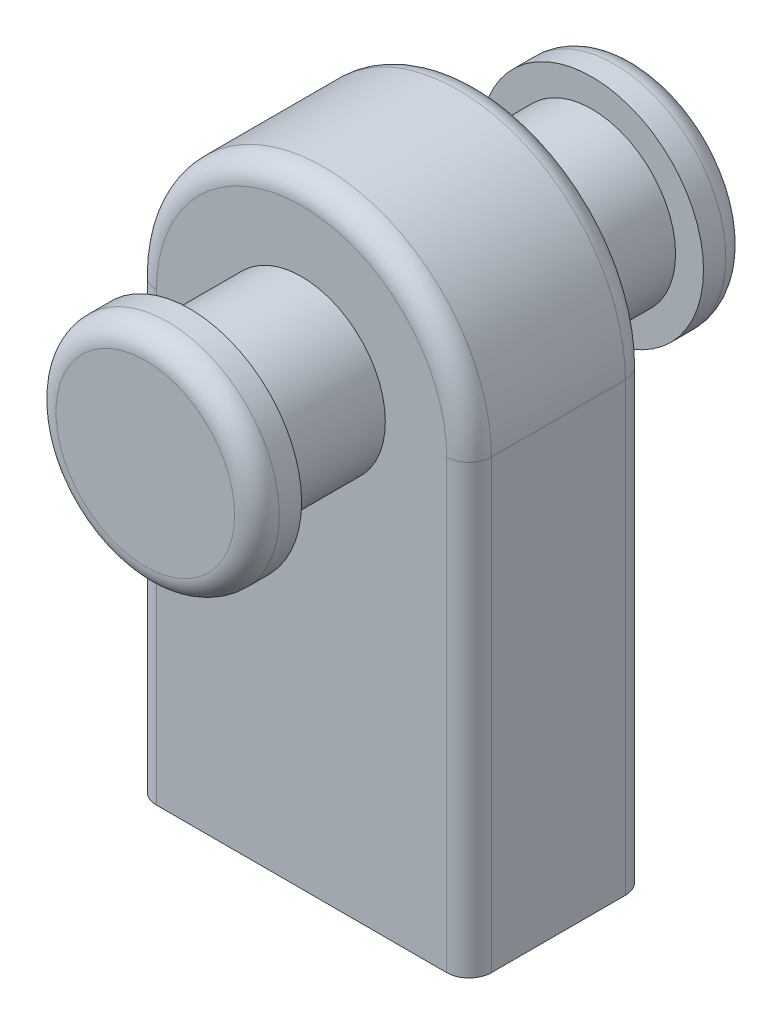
ISO-10303-21;
HEADER;
FILE_DESCRIPTION(('STEP AP214'),'2;1');
FILE_NAME('part.step','',(''),(''),'','','');
FILE_SCHEMA(('AUTOMOTIVE_DESIGN { 1 0 10303 214 1 1 1 1 }'));
ENDSEC;
DATA;
#1=APPLICATION_CONTEXT('core data for automotive mechanical design processes');
#2=APPLICATION_PROTOCOL_DEFINITION('international standard','automotive_design',2000,#1);
#3=PRODUCT_CONTEXT('',#1,'mechanical');
#4=PRODUCT('Part','Part','',(#3));
#5=PRODUCT_RELATED_PRODUCT_CATEGORY('part','',(#4));
#6=PRODUCT_DEFINITION_FORMATION('','',#4);
#7=PRODUCT_DEFINITION_CONTEXT('part definition',#1,'design');
#8=PRODUCT_DEFINITION('design','',#6,#7);
#9=PRODUCT_DEFINITION_SHAPE('','',#8);
#10=(LENGTH_UNIT() NAMED_UNIT(*) SI_UNIT(.MILLI.,.METRE.));
#11=(NAMED_UNIT(*) PLANE_ANGLE_UNIT() SI_UNIT($,.RADIAN.));
#12=(NAMED_UNIT(*) SI_UNIT($,.STERADIAN.) SOLID_ANGLE_UNIT());
#13=UNCERTAINTY_MEASURE_WITH_UNIT(LENGTH_MEASURE(1.E-05),#10,'distance_accuracy_value','');
#14=(GEOMETRIC_REPRESENTATION_CONTEXT(3) GLOBAL_UNCERTAINTY_ASSIGNED_CONTEXT((#13)) GLOBAL_UNIT_ASSIGNED_CONTEXT((#10,
#11,#12)) REPRESENTATION_CONTEXT('',''));
#15=CARTESIAN_POINT('',(0.,0.,0.));
#16=DIRECTION('',(0.,0.,1.));
#17=DIRECTION('',(1.,0.,0.));
#18=AXIS2_PLACEMENT_3D('',#15,#16,#17);
#19=CARTESIAN_POINT('',(0.,0.,10.16));
#20=DIRECTION('',(0.,0.,-1.));
#21=DIRECTION('',(-1.,0.,0.));
#22=AXIS2_PLACEMENT_3D('',#19,#20,#21);
#23=CYLINDRICAL_SURFACE('',#22,19.05);
#24=DIRECTION('',(0.,0.,-1.));
#25=VECTOR('',#24,1.);
#26=CARTESIAN_POINT('',(19.05,0.,10.16));
#27=LINE('',#26,#25);
#28=CARTESIAN_POINT('',(19.05,0.,7.62));
#29=VERTEX_POINT('',#28);
#30=CARTESIAN_POINT('',(19.05,0.,-7.62));
#31=VERTEX_POINT('',#30);
#32=EDGE_CURVE('E112',#29,#31,#27,.T.);
#33=ORIENTED_EDGE('',*,*,#32,.T.);
#34=CARTESIAN_POINT('',(0.,0.,-7.62));
#35=DIRECTION('',(0.,0.,1.));
#36=DIRECTION('',(1.,0.,0.));
#37=AXIS2_PLACEMENT_3D('',#34,#35,#36);
#38=CIRCLE('',#37,19.05);
#39=CARTESIAN_POINT('',(-19.05,0.,-7.62));
#40=VERTEX_POINT('',#39);
#41=EDGE_CURVE('E137',#31,#40,#38,.T.);
#42=ORIENTED_EDGE('',*,*,#41,.T.);
#43=DIRECTION('',(0.,0.,-1.));
#44=VECTOR('',#43,1.);
#45=CARTESIAN_POINT('',(-19.05,0.,10.16));
#46=LINE('',#45,#44);
#47=CARTESIAN_POINT('',(-19.05,0.,7.62));
#48=VERTEX_POINT('',#47);
#49=EDGE_CURVE('E167',#48,#40,#46,.T.);
#50=ORIENTED_EDGE('',*,*,#49,.F.);
#51=CARTESIAN_POINT('',(0.,0.,7.62));
#52=DIRECTION('',(0.,0.,1.));
#53=DIRECTION('',(1.,0.,0.));
#54=AXIS2_PLACEMENT_3D('',#51,#52,#53);
#55=CIRCLE('',#54,19.05);
#56=EDGE_CURVE('E135',#48,#29,#55,.F.);
#57=ORIENTED_EDGE('',*,*,#56,.T.);
#58=EDGE_LOOP('',(#33,#42,#50,#57));
#59=FACE_BOUND('',#58,.T.);
#60=ADVANCED_FACE('F34',(#59),#23,.T.);
#61=CARTESIAN_POINT('',(-19.05,0.,10.16));
#62=DIRECTION('',(1.,0.,0.));
#63=DIRECTION('',(0.,1.,0.));
#64=AXIS2_PLACEMENT_3D('',#61,#62,#63);
#65=PLANE('',#64);
#66=ORIENTED_EDGE('',*,*,#49,.T.);
#67=DIRECTION('',(0.,-1.,0.));
#68=VECTOR('',#67,1.);
#69=CARTESIAN_POINT('',(-19.05,0.,-7.62));
#70=LINE('',#69,#68);
#71=CARTESIAN_POINT('',(-19.05,-50.8,-7.62));
#72=VERTEX_POINT('',#71);
#73=EDGE_CURVE('E165',#40,#72,#70,.T.);
#74=ORIENTED_EDGE('',*,*,#73,.T.);
#75=DIRECTION('',(0.,0.,-1.));
#76=VECTOR('',#75,1.);
#77=CARTESIAN_POINT('',(-19.05,-50.8,10.16));
#78=LINE('',#77,#76);
#79=CARTESIAN_POINT('',(-19.05,-50.8,7.62));
#80=VERTEX_POINT('',#79);
#81=EDGE_CURVE('E158',#80,#72,#78,.T.);
#82=ORIENTED_EDGE('',*,*,#81,.F.);
#83=DIRECTION('',(0.,-1.,0.));
#84=VECTOR('',#83,1.);
#85=CARTESIAN_POINT('',(-19.05,0.,7.62));
#86=LINE('',#85,#84);
#87=EDGE_CURVE('E156',#80,#48,#86,.F.);
#88=ORIENTED_EDGE('',*,*,#87,.T.);
#89=EDGE_LOOP('',(#66,#74,#82,#88));
#90=FACE_BOUND('',#89,.T.);
#91=ADVANCED_FACE('F162',(#90),#65,.F.);
#92=CARTESIAN_POINT('',(19.05,0.,10.16));
#93=DIRECTION('',(1.,0.,0.));
#94=DIRECTION('',(0.,1.,0.));
#95=AXIS2_PLACEMENT_3D('',#92,#93,#94);
#96=PLANE('',#95);
#97=DIRECTION('',(0.,0.,-1.));
#98=VECTOR('',#97,1.);
#99=CARTESIAN_POINT('',(19.05,-50.8,10.16));
#100=LINE('',#99,#98);
#101=CARTESIAN_POINT('',(19.05,-50.8,7.62));
#102=VERTEX_POINT('',#101);
#103=CARTESIAN_POINT('',(19.05,-50.8,-7.62));
#104=VERTEX_POINT('',#103);
#105=EDGE_CURVE('E102',#102,#104,#100,.T.);
#106=ORIENTED_EDGE('',*,*,#105,.T.);
#107=DIRECTION('',(0.,-1.,0.));
#108=VECTOR('',#107,1.);
#109=CARTESIAN_POINT('',(19.05,0.,-7.62));
#110=LINE('',#109,#108);
#111=EDGE_CURVE('E185',#104,#31,#110,.F.);
#112=ORIENTED_EDGE('',*,*,#111,.T.);
#113=ORIENTED_EDGE('',*,*,#32,.F.);
#114=DIRECTION('',(0.,-1.,0.));
#115=VECTOR('',#114,1.);
#116=CARTESIAN_POINT('',(19.05,0.,7.62));
#117=LINE('',#116,#115);
#118=EDGE_CURVE('E183',#29,#102,#117,.T.);
#119=ORIENTED_EDGE('',*,*,#118,.T.);
#120=EDGE_LOOP('',(#106,#112,#113,#119));
#121=FACE_BOUND('',#120,.T.);
#122=ADVANCED_FACE('F192',(#121),#96,.T.);
#123=CARTESIAN_POINT('',(0.,0.,10.16));
#124=DIRECTION('',(0.,0.,1.));
#125=DIRECTION('',(1.,0.,0.));
#126=AXIS2_PLACEMENT_3D('',#123,#124,#125);
#127=PLANE('',#126);
#128=DIRECTION('',(-1.,0.,0.));
#129=VECTOR('',#128,1.);
#130=CARTESIAN_POINT('',(0.,-50.8,10.16));
#131=LINE('',#130,#129);
#132=CARTESIAN_POINT('',(16.51,-50.8,10.16));
#133=VERTEX_POINT('',#132);
#134=CARTESIAN_POINT('',(-16.51,-50.8,10.16));
#135=VERTEX_POINT('',#134);
#136=EDGE_CURVE('E100',#133,#135,#131,.T.);
#137=ORIENTED_EDGE('',*,*,#136,.F.);
#138=DIRECTION('',(0.,-1.,0.));
#139=VECTOR('',#138,1.);
#140=CARTESIAN_POINT('',(16.51,0.,10.16));
#141=LINE('',#140,#139);
#142=CARTESIAN_POINT('',(16.51,0.,10.16));
#143=VERTEX_POINT('',#142);
#144=EDGE_CURVE('E56',#133,#143,#141,.F.);
#145=ORIENTED_EDGE('',*,*,#144,.T.);
#146=CARTESIAN_POINT('',(0.,0.,10.16));
#147=DIRECTION('',(0.,0.,1.));
#148=DIRECTION('',(1.,0.,0.));
#149=AXIS2_PLACEMENT_3D('',#146,#147,#148);
#150=CIRCLE('',#149,16.51);
#151=CARTESIAN_POINT('',(-16.51,0.,10.16));
#152=VERTEX_POINT('',#151);
#153=EDGE_CURVE('E51',#143,#152,#150,.T.);
#154=ORIENTED_EDGE('',*,*,#153,.T.);
#155=DIRECTION('',(0.,-1.,0.));
#156=VECTOR('',#155,1.);
#157=CARTESIAN_POINT('',(-16.51,-50.8,10.16));
#158=LINE('',#157,#156);
#159=EDGE_CURVE('E110',#152,#135,#158,.T.);
#160=ORIENTED_EDGE('',*,*,#159,.T.);
#161=EDGE_LOOP('',(#137,#145,#154,#160));
#162=FACE_BOUND('',#161,.T.);
#163=CARTESIAN_POINT('',(0.,0.,10.16));
#164=DIRECTION('',(0.,0.,1.));
#165=DIRECTION('',(1.,0.,0.));
#166=AXIS2_PLACEMENT_3D('',#163,#164,#165);
#167=CIRCLE('',#166,9.525);
#168=CARTESIAN_POINT('',(9.525,0.,10.16));
#169=VERTEX_POINT('',#168);
#170=EDGE_CURVE('E210',#169,#169,#167,.F.);
#171=ORIENTED_EDGE('',*,*,#170,.T.);
#172=EDGE_LOOP('',(#171));
#173=FACE_BOUND('',#172,.T.);
#174=ADVANCED_FACE('F108',(#162,#173),#127,.T.);
#175=CARTESIAN_POINT('',(0.,0.,-10.16));
#176=DIRECTION('',(0.,0.,1.));
#177=DIRECTION('',(1.,0.,0.));
#178=AXIS2_PLACEMENT_3D('',#175,#176,#177);
#179=PLANE('',#178);
#180=CARTESIAN_POINT('',(0.,0.,-10.16));
#181=DIRECTION('',(0.,0.,1.));
#182=DIRECTION('',(1.,0.,0.));
#183=AXIS2_PLACEMENT_3D('',#180,#181,#182);
#184=CIRCLE('',#183,9.525);
#185=CARTESIAN_POINT('',(9.525,0.,-10.16));
#186=VERTEX_POINT('',#185);
#187=EDGE_CURVE('E169',#186,#186,#184,.F.);
#188=ORIENTED_EDGE('',*,*,#187,.F.);
#189=EDGE_LOOP('',(#188));
#190=FACE_BOUND('',#189,.T.);
#191=CARTESIAN_POINT('',(0.,0.,-10.16));
#192=DIRECTION('',(0.,0.,1.));
#193=DIRECTION('',(1.,0.,0.));
#194=AXIS2_PLACEMENT_3D('',#191,#192,#193);
#195=CIRCLE('',#194,16.51);
#196=CARTESIAN_POINT('',(-16.51,0.,-10.16));
#197=VERTEX_POINT('',#196);
#198=CARTESIAN_POINT('',(16.51,0.,-10.16));
#199=VERTEX_POINT('',#198);
#200=EDGE_CURVE('E176',#197,#199,#195,.F.);
#201=ORIENTED_EDGE('',*,*,#200,.T.);
#202=DIRECTION('',(0.,-1.,0.));
#203=VECTOR('',#202,1.);
#204=CARTESIAN_POINT('',(16.51,-50.8,-10.16));
#205=LINE('',#204,#203);
#206=CARTESIAN_POINT('',(16.51,-50.8,-10.16));
#207=VERTEX_POINT('',#206);
#208=EDGE_CURVE('E180',#199,#207,#205,.T.);
#209=ORIENTED_EDGE('',*,*,#208,.T.);
#210=DIRECTION('',(-1.,0.,0.));
#211=VECTOR('',#210,1.);
#212=CARTESIAN_POINT('',(0.,-50.8,-10.16));
#213=LINE('',#212,#211);
#214=CARTESIAN_POINT('',(-16.51,-50.8,-10.16));
#215=VERTEX_POINT('',#214);
#216=EDGE_CURVE('E113',#207,#215,#213,.T.);
#217=ORIENTED_EDGE('',*,*,#216,.T.);
#218=DIRECTION('',(0.,-1.,0.));
#219=VECTOR('',#218,1.);
#220=CARTESIAN_POINT('',(-16.51,0.,-10.16));
#221=LINE('',#220,#219);
#222=EDGE_CURVE('E178',#215,#197,#221,.F.);
#223=ORIENTED_EDGE('',*,*,#222,.T.);
#224=EDGE_LOOP('',(#201,#209,#217,#223));
#225=FACE_BOUND('',#224,.T.);
#226=ADVANCED_FACE('F206',(#190,#225),#179,.F.);
#227=CARTESIAN_POINT('',(0.,0.,22.86));
#228=DIRECTION('',(0.,0.,-1.));
#229=DIRECTION('',(-1.,0.,0.));
#230=AXIS2_PLACEMENT_3D('',#227,#228,#229);
#231=CYLINDRICAL_SURFACE('',#230,9.525);
#232=CARTESIAN_POINT('',(0.,0.,-22.86));
#233=DIRECTION('',(0.,0.,1.));
#234=DIRECTION('',(1.,0.,0.));
#235=AXIS2_PLACEMENT_3D('',#232,#233,#234);
#236=CIRCLE('',#235,9.525);
#237=CARTESIAN_POINT('',(9.525,0.,-22.86));
#238=VERTEX_POINT('',#237);
#239=EDGE_CURVE('E216',#238,#238,#236,.T.);
#240=ORIENTED_EDGE('',*,*,#239,.T.);
#241=EDGE_LOOP('',(#240));
#242=FACE_BOUND('',#241,.T.);
#243=ORIENTED_EDGE('',*,*,#187,.T.);
#244=EDGE_LOOP('',(#243));
#245=FACE_BOUND('',#244,.T.);
#246=ADVANCED_FACE('F287',(#242,#245),#231,.T.);
#247=ORIENTED_EDGE('',*,*,#170,.F.);
#248=EDGE_LOOP('',(#247));
#249=FACE_BOUND('',#248,.T.);
#250=CARTESIAN_POINT('',(0.,0.,22.86));
#251=DIRECTION('',(0.,0.,1.));
#252=DIRECTION('',(1.,0.,0.));
#253=AXIS2_PLACEMENT_3D('',#250,#251,#252);
#254=CIRCLE('',#253,9.525);
#255=CARTESIAN_POINT('',(9.525,0.,22.86));
#256=VERTEX_POINT('',#255);
#257=EDGE_CURVE('E213',#256,#256,#254,.T.);
#258=ORIENTED_EDGE('',*,*,#257,.F.);
#259=EDGE_LOOP('',(#258));
#260=FACE_BOUND('',#259,.T.);
#261=ADVANCED_FACE('F281',(#249,#260),#231,.T.);
#262=CARTESIAN_POINT('',(0.,0.,27.94));
#263=DIRECTION('',(0.,0.,-1.));
#264=DIRECTION('',(-1.,0.,0.));
#265=AXIS2_PLACEMENT_3D('',#262,#263,#264);
#266=CYLINDRICAL_SURFACE('',#265,12.7);
#267=CARTESIAN_POINT('',(0.,0.,25.4));
#268=DIRECTION('',(0.,0.,1.));
#269=DIRECTION('',(1.,0.,0.));
#270=AXIS2_PLACEMENT_3D('',#267,#268,#269);
#271=CIRCLE('',#270,12.7);
#272=CARTESIAN_POINT('',(12.7,0.,25.4));
#273=VERTEX_POINT('',#272);
#274=EDGE_CURVE('E122',#273,#273,#271,.F.);
#275=ORIENTED_EDGE('',*,*,#274,.T.);
#276=EDGE_LOOP('',(#275));
#277=FACE_BOUND('',#276,.T.);
#278=CARTESIAN_POINT('',(0.,0.,22.86));
#279=DIRECTION('',(0.,0.,1.));
#280=DIRECTION('',(1.,0.,0.));
#281=AXIS2_PLACEMENT_3D('',#278,#279,#280);
#282=CIRCLE('',#281,12.7);
#283=CARTESIAN_POINT('',(12.7,0.,22.86));
#284=VERTEX_POINT('',#283);
#285=EDGE_CURVE('E219',#284,#284,#282,.T.);
#286=ORIENTED_EDGE('',*,*,#285,.T.);
#287=EDGE_LOOP('',(#286));
#288=FACE_BOUND('',#287,.T.);
#289=ADVANCED_FACE('F277',(#277,#288),#266,.T.);
#290=CARTESIAN_POINT('',(0.,0.,27.94));
#291=DIRECTION('',(0.,0.,1.));
#292=DIRECTION('',(1.,0.,0.));
#293=AXIS2_PLACEMENT_3D('',#290,#291,#292);
#294=PLANE('',#293);
#295=CARTESIAN_POINT('',(0.,0.,27.94));
#296=DIRECTION('',(0.,0.,1.));
#297=DIRECTION('',(1.,0.,0.));
#298=AXIS2_PLACEMENT_3D('',#295,#296,#297);
#299=CIRCLE('',#298,10.16);
#300=CARTESIAN_POINT('',(10.16,0.,27.94));
#301=VERTEX_POINT('',#300);
#302=EDGE_CURVE('E119',#301,#301,#299,.T.);
#303=ORIENTED_EDGE('',*,*,#302,.T.);
#304=EDGE_LOOP('',(#303));
#305=FACE_BOUND('',#304,.T.);
#306=ADVANCED_FACE('F241',(#305),#294,.T.);
#307=CARTESIAN_POINT('',(0.,0.,22.86));
#308=DIRECTION('',(0.,0.,1.));
#309=DIRECTION('',(1.,0.,0.));
#310=AXIS2_PLACEMENT_3D('',#307,#308,#309);
#311=PLANE('',#310);
#312=ORIENTED_EDGE('',*,*,#257,.T.);
#313=EDGE_LOOP('',(#312));
#314=FACE_BOUND('',#313,.T.);
#315=ORIENTED_EDGE('',*,*,#285,.F.);
#316=EDGE_LOOP('',(#315));
#317=FACE_BOUND('',#316,.T.);
#318=ADVANCED_FACE('F232',(#314,#317),#311,.F.);
#319=CARTESIAN_POINT('',(0.,0.,-27.94));
#320=DIRECTION('',(0.,0.,1.));
#321=DIRECTION('',(1.,0.,0.));
#322=AXIS2_PLACEMENT_3D('',#319,#320,#321);
#323=CYLINDRICAL_SURFACE('',#322,12.7);
#324=CARTESIAN_POINT('',(0.,0.,-25.4));
#325=DIRECTION('',(0.,0.,-1.));
#326=DIRECTION('',(-1.,0.,0.));
#327=AXIS2_PLACEMENT_3D('',#324,#325,#326);
#328=CIRCLE('',#327,12.7);
#329=CARTESIAN_POINT('',(-12.7,0.,-25.4));
#330=VERTEX_POINT('',#329);
#331=EDGE_CURVE('E129',#330,#330,#328,.F.);
#332=ORIENTED_EDGE('',*,*,#331,.T.);
#333=EDGE_LOOP('',(#332));
#334=FACE_BOUND('',#333,.T.);
#335=CARTESIAN_POINT('',(0.,0.,-22.86));
#336=DIRECTION('',(0.,0.,1.));
#337=DIRECTION('',(1.,0.,0.));
#338=AXIS2_PLACEMENT_3D('',#335,#336,#337);
#339=CIRCLE('',#338,12.7);
#340=CARTESIAN_POINT('',(12.7,0.,-22.86));
#341=VERTEX_POINT('',#340);
#342=EDGE_CURVE('E147',#341,#341,#339,.T.);
#343=ORIENTED_EDGE('',*,*,#342,.F.);
#344=EDGE_LOOP('',(#343));
#345=FACE_BOUND('',#344,.T.);
#346=ADVANCED_FACE('F229',(#334,#345),#323,.T.);
#347=CARTESIAN_POINT('',(0.,0.,-27.94));
#348=DIRECTION('',(0.,0.,-1.));
#349=DIRECTION('',(1.,0.,0.));
#350=AXIS2_PLACEMENT_3D('',#347,#348,#349);
#351=PLANE('',#350);
#352=CARTESIAN_POINT('',(0.,0.,-27.94));
#353=DIRECTION('',(0.,0.,-1.));
#354=DIRECTION('',(-1.,0.,0.));
#355=AXIS2_PLACEMENT_3D('',#352,#353,#354);
#356=CIRCLE('',#355,10.16);
#357=CARTESIAN_POINT('',(-10.16,0.,-27.94));
#358=VERTEX_POINT('',#357);
#359=EDGE_CURVE('E132',#358,#358,#356,.T.);
#360=ORIENTED_EDGE('',*,*,#359,.T.);
#361=EDGE_LOOP('',(#360));
#362=FACE_BOUND('',#361,.T.);
#363=ADVANCED_FACE('F231',(#362),#351,.T.);
#364=CARTESIAN_POINT('',(0.,0.,-22.86));
#365=DIRECTION('',(0.,0.,-1.));
#366=DIRECTION('',(1.,0.,0.));
#367=AXIS2_PLACEMENT_3D('',#364,#365,#366);
#368=PLANE('',#367);
#369=ORIENTED_EDGE('',*,*,#239,.F.);
#370=EDGE_LOOP('',(#369));
#371=FACE_BOUND('',#370,.T.);
#372=ORIENTED_EDGE('',*,*,#342,.T.);
#373=EDGE_LOOP('',(#372));
#374=FACE_BOUND('',#373,.T.);
#375=ADVANCED_FACE('F227',(#371,#374),#368,.F.);
#376=CARTESIAN_POINT('',(-16.51,0.,-7.62));
#377=DIRECTION('',(0.,-1.,0.));
#378=DIRECTION('',(1.,0.,0.));
#379=AXIS2_PLACEMENT_3D('',#376,#377,#378);
#380=CYLINDRICAL_SURFACE('',#379,2.54);
#381=CARTESIAN_POINT('',(-16.51,-50.8,-7.62));
#382=DIRECTION('',(0.,-1.,0.));
#383=DIRECTION('',(0.,0.,-1.));
#384=AXIS2_PLACEMENT_3D('',#381,#382,#383);
#385=CIRCLE('',#384,2.54);
#386=EDGE_CURVE('E106',#72,#215,#385,.T.);
#387=ORIENTED_EDGE('',*,*,#386,.F.);
#388=ORIENTED_EDGE('',*,*,#73,.F.);
#389=CARTESIAN_POINT('',(-16.51,0.,-7.62));
#390=DIRECTION('',(0.,1.,0.));
#391=DIRECTION('',(-1.,0.,0.));
#392=AXIS2_PLACEMENT_3D('',#389,#390,#391);
#393=CIRCLE('',#392,2.54);
#394=EDGE_CURVE('E145',#197,#40,#393,.T.);
#395=ORIENTED_EDGE('',*,*,#394,.F.);
#396=ORIENTED_EDGE('',*,*,#222,.F.);
#397=EDGE_LOOP('',(#387,#388,#395,#396));
#398=FACE_BOUND('',#397,.T.);
#399=ADVANCED_FACE('F209',(#398),#380,.T.);
#400=CARTESIAN_POINT('',(0.,0.,-7.62));
#401=DIRECTION('',(0.,0.,1.));
#402=DIRECTION('',(1.,0.,0.));
#403=AXIS2_PLACEMENT_3D('',#400,#401,#402);
#404=TOROIDAL_SURFACE('',#403,16.51,2.54);
#405=ORIENTED_EDGE('',*,*,#394,.T.);
#406=ORIENTED_EDGE('',*,*,#41,.F.);
#407=CARTESIAN_POINT('',(16.51,0.,-7.62));
#408=DIRECTION('',(0.,-1.,0.));
#409=DIRECTION('',(1.,0.,0.));
#410=AXIS2_PLACEMENT_3D('',#407,#408,#409);
#411=CIRCLE('',#410,2.54);
#412=EDGE_CURVE('E142',#199,#31,#411,.T.);
#413=ORIENTED_EDGE('',*,*,#412,.F.);
#414=ORIENTED_EDGE('',*,*,#200,.F.);
#415=EDGE_LOOP('',(#405,#406,#413,#414));
#416=FACE_BOUND('',#415,.T.);
#417=ADVANCED_FACE('F199',(#416),#404,.T.);
#418=CARTESIAN_POINT('',(16.51,0.,-7.62));
#419=DIRECTION('',(0.,1.,0.));
#420=DIRECTION('',(-1.,0.,0.));
#421=AXIS2_PLACEMENT_3D('',#418,#419,#420);
#422=CYLINDRICAL_SURFACE('',#421,2.54);
#423=ORIENTED_EDGE('',*,*,#412,.T.);
#424=ORIENTED_EDGE('',*,*,#111,.F.);
#425=CARTESIAN_POINT('',(16.51,-50.8,-7.62));
#426=DIRECTION('',(0.,-1.,0.));
#427=DIRECTION('',(0.,0.,-1.));
#428=AXIS2_PLACEMENT_3D('',#425,#426,#427);
#429=CIRCLE('',#428,2.54);
#430=EDGE_CURVE('E139',#207,#104,#429,.T.);
#431=ORIENTED_EDGE('',*,*,#430,.F.);
#432=ORIENTED_EDGE('',*,*,#208,.F.);
#433=EDGE_LOOP('',(#423,#424,#431,#432));
#434=FACE_BOUND('',#433,.T.);
#435=ADVANCED_FACE('F203',(#434),#422,.T.);
#436=CARTESIAN_POINT('',(-16.51,0.,7.62));
#437=DIRECTION('',(0.,1.,0.));
#438=DIRECTION('',(-1.,0.,0.));
#439=AXIS2_PLACEMENT_3D('',#436,#437,#438);
#440=CYLINDRICAL_SURFACE('',#439,2.54);
#441=CARTESIAN_POINT('',(-16.51,-50.8,7.62));
#442=DIRECTION('',(0.,-1.,0.));
#443=DIRECTION('',(0.,0.,-1.));
#444=AXIS2_PLACEMENT_3D('',#441,#442,#443);
#445=CIRCLE('',#444,2.54);
#446=EDGE_CURVE('E11',#135,#80,#445,.T.);
#447=ORIENTED_EDGE('',*,*,#446,.F.);
#448=ORIENTED_EDGE('',*,*,#159,.F.);
#449=CARTESIAN_POINT('',(-16.51,0.,7.62));
#450=DIRECTION('',(0.,1.,0.));
#451=DIRECTION('',(-1.,0.,0.));
#452=AXIS2_PLACEMENT_3D('',#449,#450,#451);
#453=CIRCLE('',#452,2.54);
#454=EDGE_CURVE('E38',#48,#152,#453,.T.);
#455=ORIENTED_EDGE('',*,*,#454,.F.);
#456=ORIENTED_EDGE('',*,*,#87,.F.);
#457=EDGE_LOOP('',(#447,#448,#455,#456));
#458=FACE_BOUND('',#457,.T.);
#459=ADVANCED_FACE('F155',(#458),#440,.T.);
#460=CARTESIAN_POINT('',(0.,0.,7.62));
#461=DIRECTION('',(0.,0.,1.));
#462=DIRECTION('',(1.,0.,0.));
#463=AXIS2_PLACEMENT_3D('',#460,#461,#462);
#464=TOROIDAL_SURFACE('',#463,16.51,2.54);
#465=ORIENTED_EDGE('',*,*,#454,.T.);
#466=ORIENTED_EDGE('',*,*,#153,.F.);
#467=CARTESIAN_POINT('',(16.51,0.,7.62));
#468=DIRECTION('',(0.,-1.,0.));
#469=DIRECTION('',(0.,0.,-1.));
#470=AXIS2_PLACEMENT_3D('',#467,#468,#469);
#471=CIRCLE('',#470,2.54);
#472=EDGE_CURVE('E118',#29,#143,#471,.T.);
#473=ORIENTED_EDGE('',*,*,#472,.F.);
#474=ORIENTED_EDGE('',*,*,#56,.F.);
#475=EDGE_LOOP('',(#465,#466,#473,#474));
#476=FACE_BOUND('',#475,.T.);
#477=ADVANCED_FACE('F152',(#476),#464,.T.);
#478=CARTESIAN_POINT('',(16.51,0.,7.62));
#479=DIRECTION('',(0.,-1.,0.));
#480=DIRECTION('',(1.,0.,0.));
#481=AXIS2_PLACEMENT_3D('',#478,#479,#480);
#482=CYLINDRICAL_SURFACE('',#481,2.54);
#483=ORIENTED_EDGE('',*,*,#472,.T.);
#484=ORIENTED_EDGE('',*,*,#144,.F.);
#485=CARTESIAN_POINT('',(16.51,-50.8,7.62));
#486=DIRECTION('',(0.,-1.,0.));
#487=DIRECTION('',(0.,0.,-1.));
#488=AXIS2_PLACEMENT_3D('',#485,#486,#487);
#489=CIRCLE('',#488,2.54);
#490=EDGE_CURVE('E43',#102,#133,#489,.T.);
#491=ORIENTED_EDGE('',*,*,#490,.F.);
#492=ORIENTED_EDGE('',*,*,#118,.F.);
#493=EDGE_LOOP('',(#483,#484,#491,#492));
#494=FACE_BOUND('',#493,.T.);
#495=ADVANCED_FACE('F116',(#494),#482,.T.);
#496=CARTESIAN_POINT('',(0.,0.,25.4));
#497=DIRECTION('',(0.,0.,1.));
#498=DIRECTION('',(1.,0.,0.));
#499=AXIS2_PLACEMENT_3D('',#496,#497,#498);
#500=TOROIDAL_SURFACE('',#499,10.16,2.54);
#501=ORIENTED_EDGE('',*,*,#274,.F.);
#502=EDGE_LOOP('',(#501));
#503=FACE_BOUND('',#502,.T.);
#504=ORIENTED_EDGE('',*,*,#302,.F.);
#505=EDGE_LOOP('',(#504));
#506=FACE_BOUND('',#505,.T.);
#507=ADVANCED_FACE('F262',(#503,#506),#500,.T.);
#508=CARTESIAN_POINT('',(0.,0.,-25.4));
#509=DIRECTION('',(0.,0.,-1.));
#510=DIRECTION('',(-1.,0.,0.));
#511=AXIS2_PLACEMENT_3D('',#508,#509,#510);
#512=TOROIDAL_SURFACE('',#511,10.16,2.54);
#513=ORIENTED_EDGE('',*,*,#359,.F.);
#514=EDGE_LOOP('',(#513));
#515=FACE_BOUND('',#514,.T.);
#516=ORIENTED_EDGE('',*,*,#331,.F.);
#517=EDGE_LOOP('',(#516));
#518=FACE_BOUND('',#517,.T.);
#519=ADVANCED_FACE('F36',(#515,#518),#512,.T.);
#520=CARTESIAN_POINT('',(254.,-50.8,254.));
#521=DIRECTION('',(0.,-1.,0.));
#522=DIRECTION('',(0.,0.,-1.));
#523=AXIS2_PLACEMENT_3D('',#520,#521,#522);
#524=PLANE('',#523);
#525=ORIENTED_EDGE('',*,*,#216,.F.);
#526=ORIENTED_EDGE('',*,*,#430,.T.);
#527=ORIENTED_EDGE('',*,*,#105,.F.);
#528=ORIENTED_EDGE('',*,*,#490,.T.);
#529=ORIENTED_EDGE('',*,*,#136,.T.);
#530=ORIENTED_EDGE('',*,*,#446,.T.);
#531=ORIENTED_EDGE('',*,*,#81,.T.);
#532=ORIENTED_EDGE('',*,*,#386,.T.);
#533=EDGE_LOOP('',(#525,#526,#527,#528,#529,#530,#531,#532));
#534=FACE_BOUND('',#533,.T.);
#535=ADVANCED_FACE('F99',(#534),#524,.T.);
#536=CLOSED_SHELL('',(#60,#91,#122,#174,#226,#246,#261,#289,#306,#318,#346,#363,#375,#399,#417,
#435,#459,#477,#495,#507,#519,#535));
#537=MANIFOLD_SOLID_BREP('B2',#536);
#538=ADVANCED_BREP_SHAPE_REPRESENTATION('',(#18,#537),#14);
#539=SHAPE_DEFINITION_REPRESENTATION(#9,#538);
ENDSEC;
END-ISO-10303-21;
